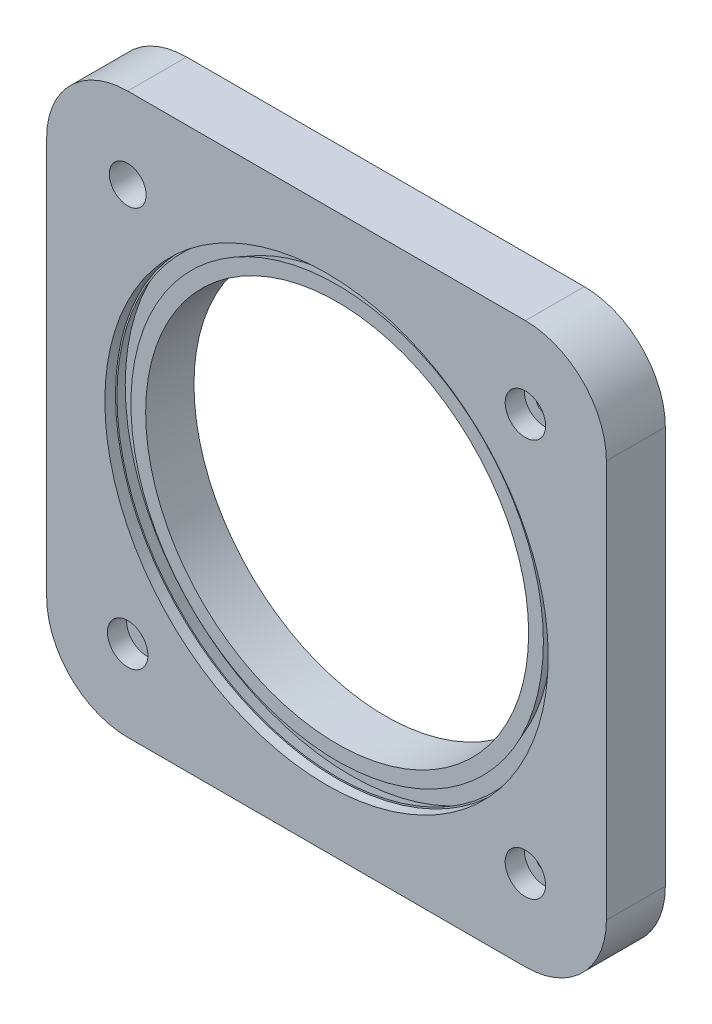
from build123d import *

# Parameters (mm, degrees)
SKETCH1_R          = 82.55
SKETCH1_R_2        = 3.3655
SKETCH1_R_3        = 7.9375
BASE_EXTRUDE_DEPTH = 25.4
SKETCH5_R          = 95.5675
CUT_EXTRUDE2_DEPTH = 4.572
SKETCH6_R          = 6.477
CUT_EXTRUDE3_DEPTH = 2.54
SKETCH7_R          = 8.7122
CUT_EXTRUDE4_DEPTH = 8.255
CUT_EXTRUDE5_START = -5.2324
SKETCH8_R          = 95.5675
SKETCH8_R_2        = 86.6267
CUT_EXTRUDE5_DEPTH = 5.2324


with BuildPart() as part:
    # Sketch1 → Base-Extrude (new body)
    with BuildSketch(Plane.XY):
        with BuildLine():
            Line((120.65, 85.725), (120.65, -85.725))
            ThreePointArc((120.65, -85.725), (110.420704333, -110.420704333), (85.725, -120.65))
            Line((85.725, -120.65), (-85.725, -120.65))
            ThreePointArc((-85.725, -120.65), (-110.420704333, -110.420704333), (-120.65, -85.725))
            Line((-120.65, -85.725), (-120.65, 85.725))
            ThreePointArc((-120.65, 85.725), (-110.420704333, 110.420704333), (-85.725, 120.65))
            Line((-85.725, 120.65), (85.725, 120.65))
            ThreePointArc((85.725, 120.65), (110.420704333, 110.420704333), (120.65, 85.725))
        make_face()
        with Locations(Location((0, 0, 0), (0, 0, 180))):
            Circle(SKETCH1_R, mode=Mode.SUBTRACT)
        with Locations(Location((-85.4964, -85.4964, 0), (0, 0, 180))):
            Circle(SKETCH1_R_2, mode=Mode.SUBTRACT)
        with Locations(Location((85.4964, 85.4964, 0), (0, 0, 180))):
            Circle(SKETCH1_R_2, mode=Mode.SUBTRACT)
        with Locations(Location((85.4964, -85.4964, 0), (0, 0, 180))):
            Circle(SKETCH1_R_2, mode=Mode.SUBTRACT)
        with Locations(Location((-85.725, 85.725, 0), (0, 0, 180))):
            Circle(SKETCH1_R_3, mode=Mode.SUBTRACT)
    extrude(amount=BASE_EXTRUDE_DEPTH)

    # Cut-Sweep1: sweep along a path in Sketch3
    with BuildLine(Plane.XY.offset(25.4)) as cut_sweep1_path:
        CenterArc((0, 0), 94.9325, 0, 360)
    # Sketch4 → Cut-Sweep1 (sweep, cut)
    with BuildSketch(Plane(origin=(0, 0, 0), x_dir=(0, 0, -1), z_dir=(1, 0, 0))):
        Polygon((-15.0876, 97.101616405), (-20.828, 94.9325), (-20.828, 88.9127), (-15.0876, 86.743583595), align=None)
    sweep(path=cut_sweep1_path.line, mode=Mode.SUBTRACT)

    # Sketch5 → Cut-Extrude2 (cut)
    with BuildSketch(Plane.XY.offset(25.4)):
        Circle(SKETCH5_R)
    extrude(amount=-CUT_EXTRUDE2_DEPTH, mode=Mode.SUBTRACT)

    # Sketch6 → Cut-Extrude3 (cut)
    with BuildSketch(Plane(origin=(0, 0, 0), x_dir=(-1, 0, 0), z_dir=(0, 0, -1))):
        with Locations((85.725, -85.725)):
            Circle(SKETCH6_R)
        with Locations(Location((-85.725, -85.725, 0), (0, 0, 180))):
            Circle(SKETCH6_R)
        with Locations((-85.725, 85.725)):
            Circle(SKETCH6_R)
    extrude(amount=-CUT_EXTRUDE3_DEPTH, mode=Mode.SUBTRACT)

    # Sketch7 → Cut-Extrude4 (cut)
    with BuildSketch(Plane.XY.offset(25.4)):
        with Locations((85.725, -85.725)):
            Circle(SKETCH7_R)
        with Locations(Location((85.725, 85.725, 0), (0, 0, 180))):
            Circle(SKETCH7_R)
        with Locations(Location((-85.725, -85.725, 0), (0, 0, 180))):
            Circle(SKETCH7_R)
    extrude(amount=-CUT_EXTRUDE4_DEPTH, mode=Mode.SUBTRACT)

    # Sketch8 → Cut-Extrude5 (cut)
    with BuildSketch(Plane(origin=(0, 0, 0), x_dir=(-1, 0, 0), z_dir=(0, 0, -1)).offset(CUT_EXTRUDE5_START)):
        with Locations(Location((0, 0, 0), (0, 0, 180))):
            Circle(SKETCH8_R)
        Circle(SKETCH8_R_2, mode=Mode.SUBTRACT)
    extrude(amount=CUT_EXTRUDE5_DEPTH, mode=Mode.SUBTRACT)


solid = part.part
